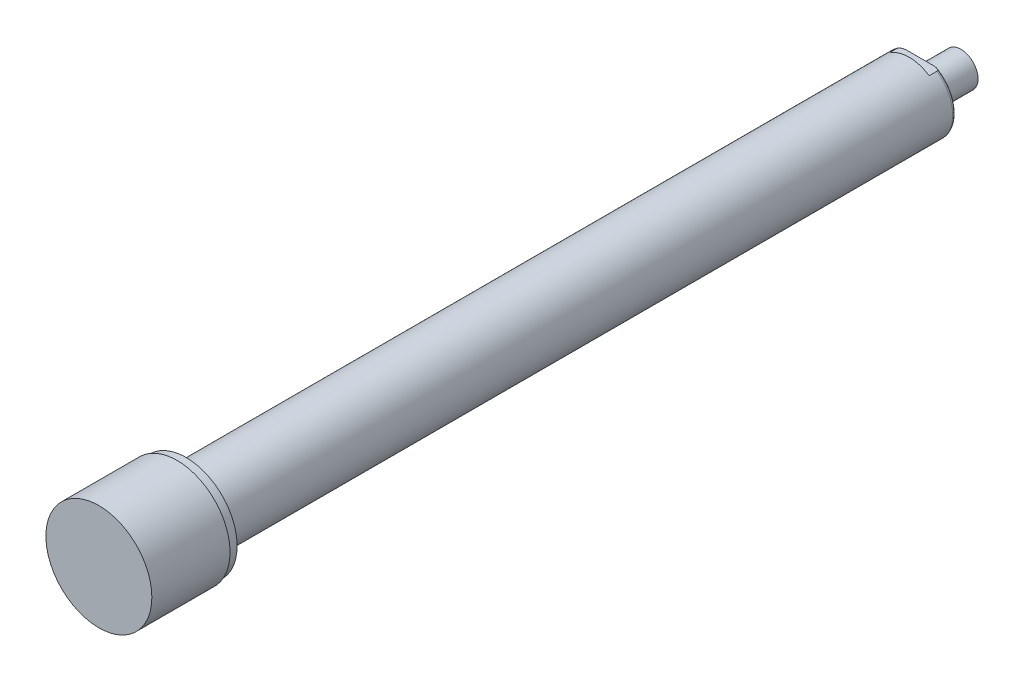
ISO-10303-21;
HEADER;
FILE_DESCRIPTION(('STEP AP214'),'2;1');
FILE_NAME('part.step','',(''),(''),'','','');
FILE_SCHEMA(('AUTOMOTIVE_DESIGN { 1 0 10303 214 1 1 1 1 }'));
ENDSEC;
DATA;
#1=APPLICATION_CONTEXT('core data for automotive mechanical design processes');
#2=APPLICATION_PROTOCOL_DEFINITION('international standard','automotive_design',2000,#1);
#3=PRODUCT_CONTEXT('',#1,'mechanical');
#4=PRODUCT('Part','Part','',(#3));
#5=PRODUCT_RELATED_PRODUCT_CATEGORY('part','',(#4));
#6=PRODUCT_DEFINITION_FORMATION('','',#4);
#7=PRODUCT_DEFINITION_CONTEXT('part definition',#1,'design');
#8=PRODUCT_DEFINITION('design','',#6,#7);
#9=PRODUCT_DEFINITION_SHAPE('','',#8);
#10=(LENGTH_UNIT() NAMED_UNIT(*) SI_UNIT(.MILLI.,.METRE.));
#11=(NAMED_UNIT(*) PLANE_ANGLE_UNIT() SI_UNIT($,.RADIAN.));
#12=(NAMED_UNIT(*) SI_UNIT($,.STERADIAN.) SOLID_ANGLE_UNIT());
#13=UNCERTAINTY_MEASURE_WITH_UNIT(LENGTH_MEASURE(1.E-05),#10,'distance_accuracy_value','');
#14=(GEOMETRIC_REPRESENTATION_CONTEXT(3) GLOBAL_UNCERTAINTY_ASSIGNED_CONTEXT((#13)) GLOBAL_UNIT_ASSIGNED_CONTEXT((#10,
#11,#12)) REPRESENTATION_CONTEXT('',''));
#15=CARTESIAN_POINT('',(0.,0.,0.));
#16=DIRECTION('',(0.,0.,1.));
#17=DIRECTION('',(1.,0.,0.));
#18=AXIS2_PLACEMENT_3D('',#15,#16,#17);
#19=CARTESIAN_POINT('',(0.,0.,2.55016));
#20=DIRECTION('',(0.,0.,1.));
#21=DIRECTION('',(1.,0.,0.));
#22=AXIS2_PLACEMENT_3D('',#19,#20,#21);
#23=PLANE('',#22);
#24=CARTESIAN_POINT('',(0.,0.,2.55016));
#25=DIRECTION('',(0.,0.,1.));
#26=DIRECTION('',(1.,0.,0.));
#27=AXIS2_PLACEMENT_3D('',#24,#25,#26);
#28=CIRCLE('',#27,24.765);
#29=CARTESIAN_POINT('',(24.765,0.,2.55016));
#30=VERTEX_POINT('',#29);
#31=EDGE_CURVE('E153',#30,#30,#28,.T.);
#32=ORIENTED_EDGE('',*,*,#31,.T.);
#33=EDGE_LOOP('',(#32));
#34=FACE_BOUND('',#33,.T.);
#35=ADVANCED_FACE('F16',(#34),#23,.T.);
#36=CARTESIAN_POINT('',(0.,0.,0.));
#37=DIRECTION('',(0.,0.,1.));
#38=DIRECTION('',(1.,0.,0.));
#39=AXIS2_PLACEMENT_3D('',#36,#37,#38);
#40=CYLINDRICAL_SURFACE('',#39,24.765);
#41=CARTESIAN_POINT('',(0.,0.,-34.));
#42=DIRECTION('',(0.,0.,1.));
#43=DIRECTION('',(1.,0.,0.));
#44=AXIS2_PLACEMENT_3D('',#41,#42,#43);
#45=CIRCLE('',#44,24.765);
#46=CARTESIAN_POINT('',(24.765,0.,-34.));
#47=VERTEX_POINT('',#46);
#48=EDGE_CURVE('E25',#47,#47,#45,.F.);
#49=ORIENTED_EDGE('',*,*,#48,.F.);
#50=EDGE_LOOP('',(#49));
#51=FACE_BOUND('',#50,.T.);
#52=ORIENTED_EDGE('',*,*,#31,.F.);
#53=EDGE_LOOP('',(#52));
#54=FACE_BOUND('',#53,.T.);
#55=ADVANCED_FACE('F262',(#51,#54),#40,.T.);
#56=CARTESIAN_POINT('',(0.,20.0152,-34.));
#57=DIRECTION('',(0.,0.,1.));
#58=DIRECTION('',(1.,0.,0.));
#59=AXIS2_PLACEMENT_3D('',#56,#57,#58);
#60=PLANE('',#59);
#61=CARTESIAN_POINT('',(0.,0.,-34.));
#62=DIRECTION('',(0.,0.,1.));
#63=DIRECTION('',(1.,0.,0.));
#64=AXIS2_PLACEMENT_3D('',#61,#62,#63);
#65=CIRCLE('',#64,23.876);
#66=CARTESIAN_POINT('',(23.876,0.,-34.));
#67=VERTEX_POINT('',#66);
#68=EDGE_CURVE('E10',#67,#67,#65,.F.);
#69=ORIENTED_EDGE('',*,*,#68,.F.);
#70=EDGE_LOOP('',(#69));
#71=FACE_BOUND('',#70,.T.);
#72=ORIENTED_EDGE('',*,*,#48,.T.);
#73=EDGE_LOOP('',(#72));
#74=FACE_BOUND('',#73,.T.);
#75=ADVANCED_FACE('F254',(#71,#74),#60,.F.);
#76=CARTESIAN_POINT('',(0.,8.,-400.4204));
#77=DIRECTION('',(0.,0.,-1.));
#78=DIRECTION('',(-1.,0.,0.));
#79=AXIS2_PLACEMENT_3D('',#76,#77,#78);
#80=PLANE('',#79);
#81=CARTESIAN_POINT('',(0.,0.,-400.4204));
#82=DIRECTION('',(0.,0.,-1.));
#83=DIRECTION('',(-1.,0.,0.));
#84=AXIS2_PLACEMENT_3D('',#81,#82,#83);
#85=CIRCLE('',#84,8.);
#86=CARTESIAN_POINT('',(-8.,0.,-400.4204));
#87=VERTEX_POINT('',#86);
#88=EDGE_CURVE('E131',#87,#87,#85,.T.);
#89=ORIENTED_EDGE('',*,*,#88,.T.);
#90=EDGE_LOOP('',(#89));
#91=FACE_BOUND('',#90,.T.);
#92=ADVANCED_FACE('F119',(#91),#80,.T.);
#93=CARTESIAN_POINT('',(0.,0.,-400.4204));
#94=DIRECTION('',(0.,0.,-1.));
#95=DIRECTION('',(-1.,0.,0.));
#96=AXIS2_PLACEMENT_3D('',#93,#94,#95);
#97=CYLINDRICAL_SURFACE('',#96,8.);
#98=CARTESIAN_POINT('',(0.,0.,-383.9104));
#99=DIRECTION('',(0.,0.,-1.));
#100=DIRECTION('',(-1.,0.,0.));
#101=AXIS2_PLACEMENT_3D('',#98,#99,#100);
#102=CIRCLE('',#101,8.);
#103=CARTESIAN_POINT('',(-8.,0.,-383.9104));
#104=VERTEX_POINT('',#103);
#105=EDGE_CURVE('E134',#104,#104,#102,.T.);
#106=ORIENTED_EDGE('',*,*,#105,.T.);
#107=EDGE_LOOP('',(#106));
#108=FACE_BOUND('',#107,.T.);
#109=ORIENTED_EDGE('',*,*,#88,.F.);
#110=EDGE_LOOP('',(#109));
#111=FACE_BOUND('',#110,.T.);
#112=ADVANCED_FACE('F238',(#108,#111),#97,.T.);
#113=CARTESIAN_POINT('',(0.,6.858,-383.9104));
#114=DIRECTION('',(0.,0.,1.));
#115=DIRECTION('',(1.,0.,0.));
#116=AXIS2_PLACEMENT_3D('',#113,#114,#115);
#117=PLANE('',#116);
#118=CARTESIAN_POINT('',(0.,0.,-383.9104));
#119=DIRECTION('',(0.,0.,-1.));
#120=DIRECTION('',(-1.,0.,0.));
#121=AXIS2_PLACEMENT_3D('',#118,#119,#120);
#122=CIRCLE('',#121,6.858);
#123=CARTESIAN_POINT('',(-6.858,0.,-383.9104));
#124=VERTEX_POINT('',#123);
#125=EDGE_CURVE('E137',#124,#124,#122,.T.);
#126=ORIENTED_EDGE('',*,*,#125,.T.);
#127=EDGE_LOOP('',(#126));
#128=FACE_BOUND('',#127,.T.);
#129=ORIENTED_EDGE('',*,*,#105,.F.);
#130=EDGE_LOOP('',(#129));
#131=FACE_BOUND('',#130,.T.);
#132=ADVANCED_FACE('F229',(#128,#131),#117,.T.);
#133=CARTESIAN_POINT('',(0.,0.,-400.4204));
#134=DIRECTION('',(0.,0.,-1.));
#135=DIRECTION('',(-1.,0.,0.));
#136=AXIS2_PLACEMENT_3D('',#133,#134,#135);
#137=CYLINDRICAL_SURFACE('',#136,6.858);
#138=CARTESIAN_POINT('',(0.,0.,-381.3704));
#139=DIRECTION('',(0.,0.,-1.));
#140=DIRECTION('',(-1.,0.,0.));
#141=AXIS2_PLACEMENT_3D('',#138,#139,#140);
#142=CIRCLE('',#141,6.858);
#143=CARTESIAN_POINT('',(-6.858,0.,-381.3704));
#144=VERTEX_POINT('',#143);
#145=EDGE_CURVE('E140',#144,#144,#142,.T.);
#146=ORIENTED_EDGE('',*,*,#145,.T.);
#147=EDGE_LOOP('',(#146));
#148=FACE_BOUND('',#147,.T.);
#149=ORIENTED_EDGE('',*,*,#125,.F.);
#150=EDGE_LOOP('',(#149));
#151=FACE_BOUND('',#150,.T.);
#152=ADVANCED_FACE('F221',(#148,#151),#137,.T.);
#153=CARTESIAN_POINT('',(0.,15.2125,-381.3704));
#154=DIRECTION('',(0.,0.,-1.));
#155=DIRECTION('',(-1.,0.,0.));
#156=AXIS2_PLACEMENT_3D('',#153,#154,#155);
#157=PLANE('',#156);
#158=DIRECTION('',(-1.,0.,0.));
#159=VECTOR('',#158,1.);
#160=CARTESIAN_POINT('',(0.,14.,-381.3704));
#161=LINE('',#160,#159);
#162=CARTESIAN_POINT('',(5.95148353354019,14.,-381.3704));
#163=VERTEX_POINT('',#162);
#164=CARTESIAN_POINT('',(-5.95148353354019,14.,-381.3704));
#165=VERTEX_POINT('',#164);
#166=EDGE_CURVE('E152',#163,#165,#161,.T.);
#167=ORIENTED_EDGE('',*,*,#166,.F.);
#168=CARTESIAN_POINT('',(0.,0.,-381.3704));
#169=DIRECTION('',(0.,0.,-1.));
#170=DIRECTION('',(-1.,0.,0.));
#171=AXIS2_PLACEMENT_3D('',#168,#169,#170);
#172=CIRCLE('',#171,15.2125);
#173=CARTESIAN_POINT('',(5.95148353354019,-14.,-381.3704));
#174=VERTEX_POINT('',#173);
#175=EDGE_CURVE('E143',#163,#174,#172,.T.);
#176=ORIENTED_EDGE('',*,*,#175,.T.);
#177=DIRECTION('',(1.,0.,0.));
#178=VECTOR('',#177,1.);
#179=CARTESIAN_POINT('',(0.,-14.,-381.3704));
#180=LINE('',#179,#178);
#181=CARTESIAN_POINT('',(-5.95148353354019,-14.,-381.3704));
#182=VERTEX_POINT('',#181);
#183=EDGE_CURVE('E150',#182,#174,#180,.T.);
#184=ORIENTED_EDGE('',*,*,#183,.F.);
#185=EDGE_CURVE('E144',#182,#165,#172,.T.);
#186=ORIENTED_EDGE('',*,*,#185,.T.);
#187=EDGE_LOOP('',(#167,#176,#184,#186));
#188=FACE_BOUND('',#187,.T.);
#189=ORIENTED_EDGE('',*,*,#145,.F.);
#190=EDGE_LOOP('',(#189));
#191=FACE_BOUND('',#190,.T.);
#192=ADVANCED_FACE('F214',(#188,#191),#157,.T.);
#193=CARTESIAN_POINT('',(0.,0.,-376.2904));
#194=DIRECTION('',(0.,0.,-1.));
#195=DIRECTION('',(-1.,0.,0.));
#196=AXIS2_PLACEMENT_3D('',#193,#194,#195);
#197=PLANE('',#196);
#198=CARTESIAN_POINT('',(0.,0.,-376.2904));
#199=DIRECTION('',(0.,0.,-1.));
#200=DIRECTION('',(-1.,0.,0.));
#201=AXIS2_PLACEMENT_3D('',#198,#199,#200);
#202=CIRCLE('',#201,16.8);
#203=CARTESIAN_POINT('',(-9.28654941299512,14.,-376.2904));
#204=VERTEX_POINT('',#203);
#205=CARTESIAN_POINT('',(9.28654941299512,14.,-376.2904));
#206=VERTEX_POINT('',#205);
#207=EDGE_CURVE('E72',#204,#206,#202,.T.);
#208=ORIENTED_EDGE('',*,*,#207,.T.);
#209=DIRECTION('',(-1.,0.,0.));
#210=VECTOR('',#209,1.);
#211=CARTESIAN_POINT('',(9.28654941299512,14.,-376.2904));
#212=LINE('',#211,#210);
#213=EDGE_CURVE('E75',#206,#204,#212,.T.);
#214=ORIENTED_EDGE('',*,*,#213,.T.);
#215=EDGE_LOOP('',(#208,#214));
#216=FACE_BOUND('',#215,.T.);
#217=ADVANCED_FACE('F74',(#216),#197,.T.);
#218=CARTESIAN_POINT('',(0.,0.,-379.7829));
#219=DIRECTION('',(0.,0.,-1.));
#220=DIRECTION('',(-1.,0.,0.));
#221=AXIS2_PLACEMENT_3D('',#218,#219,#220);
#222=TOROIDAL_SURFACE('',#221,15.2125,1.5875);
#223=CARTESIAN_POINT('',(0.,14.,-380.807595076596));
#224=CARTESIAN_POINT('',(-0.132768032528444,14.,-380.807593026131));
#225=CARTESIAN_POINT('',(-0.265533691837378,14.,-380.809844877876));
#226=CARTESIAN_POINT('',(-0.53092432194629,14.,-380.818671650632));
#227=CARTESIAN_POINT('',(-0.663549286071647,14.,-380.825246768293));
#228=CARTESIAN_POINT('',(-1.06113740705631,14.,-380.85082076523));
#229=CARTESIAN_POINT('',(-1.32572041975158,14.,-380.875667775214));
#230=CARTESIAN_POINT('',(-1.85467558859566,14.,-380.935304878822));
#231=CARTESIAN_POINT('',(-2.11904315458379,14.,-380.97013225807));
#232=CARTESIAN_POINT('',(-2.64722640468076,14.,-381.043362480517));
#233=CARTESIAN_POINT('',(-2.91104215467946,14.,-381.081764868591));
#234=CARTESIAN_POINT('',(-3.34668840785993,14.,-381.143564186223));
#235=CARTESIAN_POINT('',(-3.51843693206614,14.,-381.16751393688));
#236=CARTESIAN_POINT('',(-3.86222256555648,14.,-381.213226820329));
#237=CARTESIAN_POINT('',(-4.03425968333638,14.,-381.234989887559));
#238=CARTESIAN_POINT('',(-4.55096879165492,14.,-381.295020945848));
#239=CARTESIAN_POINT('',(-4.89633775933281,14.,-381.328046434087));
#240=CARTESIAN_POINT('',(-5.4324845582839,14.,-381.359635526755));
#241=CARTESIAN_POINT('',(-5.62271612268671,14.,-381.367024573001));
#242=CARTESIAN_POINT('',(-6.00342493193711,14.,-381.371964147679));
#243=CARTESIAN_POINT('',(-6.19390224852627,14.,-381.369510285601));
#244=CARTESIAN_POINT('',(-6.57443040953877,14.,-381.35206589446));
#245=CARTESIAN_POINT('',(-6.76448114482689,14.,-381.337072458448));
#246=CARTESIAN_POINT('',(-7.04800150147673,14.,-381.302528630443));
#247=CARTESIAN_POINT('',(-7.14221305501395,14.,-381.289012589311));
#248=CARTESIAN_POINT('',(-7.32985530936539,14.,-381.257394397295));
#249=CARTESIAN_POINT('',(-7.42328618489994,14.,-381.239293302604));
#250=CARTESIAN_POINT('',(-7.60981224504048,14.,-381.197657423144));
#251=CARTESIAN_POINT('',(-7.70289714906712,14.,-381.174075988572));
#252=CARTESIAN_POINT('',(-7.88726094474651,14.,-381.12074825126));
#253=CARTESIAN_POINT('',(-7.97854070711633,14.,-381.09100500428));
#254=CARTESIAN_POINT('',(-8.15800808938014,14.,-381.024496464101));
#255=CARTESIAN_POINT('',(-8.24620915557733,14.,-380.987767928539));
#256=CARTESIAN_POINT('',(-8.41861308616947,14.,-380.905991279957));
#257=CARTESIAN_POINT('',(-8.50282110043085,14.,-380.860954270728));
#258=CARTESIAN_POINT('',(-8.6473963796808,14.,-380.772038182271));
#259=CARTESIAN_POINT('',(-8.70893575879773,14.,-380.730080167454));
#260=CARTESIAN_POINT('',(-8.82695536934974,14.,-380.639330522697));
#261=CARTESIAN_POINT('',(-8.88342980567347,14.,-380.590531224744));
#262=CARTESIAN_POINT('',(-8.98963579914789,14.,-380.484856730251));
#263=CARTESIAN_POINT('',(-9.03928619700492,14.,-380.427898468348));
#264=CARTESIAN_POINT('',(-9.12777987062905,14.,-380.3061116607));
#265=CARTESIAN_POINT('',(-9.16665238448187,14.,-380.24130510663));
#266=CARTESIAN_POINT('',(-9.22003745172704,14.,-380.125711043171));
#267=CARTESIAN_POINT('',(-9.23836397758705,14.,-380.076688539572));
#268=CARTESIAN_POINT('',(-9.26663253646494,14.,-379.976274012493));
#269=CARTESIAN_POINT('',(-9.27658176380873,14.,-379.924884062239));
#270=CARTESIAN_POINT('',(-9.28727482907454,14.,-379.82094216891));
#271=CARTESIAN_POINT('',(-9.28798383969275,14.,-379.76838657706));
#272=CARTESIAN_POINT('',(-9.28004044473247,14.,-379.66398713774));
#273=CARTESIAN_POINT('',(-9.27138562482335,14.,-379.612143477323));
#274=CARTESIAN_POINT('',(-9.24609238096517,14.,-379.513096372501));
#275=CARTESIAN_POINT('',(-9.22985055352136,14.,-379.465789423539));
#276=CARTESIAN_POINT('',(-9.19066177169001,14.,-379.374071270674));
#277=CARTESIAN_POINT('',(-9.16771223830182,14.,-379.329661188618));
#278=CARTESIAN_POINT('',(-9.10285320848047,14.,-379.221841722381));
#279=CARTESIAN_POINT('',(-9.05730159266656,14.,-379.160624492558));
#280=CARTESIAN_POINT('',(-8.95711629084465,14.,-379.04613877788));
#281=CARTESIAN_POINT('',(-8.90245884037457,14.,-378.992891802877));
#282=CARTESIAN_POINT('',(-8.75205778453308,14.,-378.863960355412));
#283=CARTESIAN_POINT('',(-8.65138838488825,14.,-378.794065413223));
#284=CARTESIAN_POINT('',(-8.44094705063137,14.,-378.669906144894));
#285=CARTESIAN_POINT('',(-8.33115456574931,14.,-378.615678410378));
#286=CARTESIAN_POINT('',(-8.11312892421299,14.,-378.522886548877));
#287=CARTESIAN_POINT('',(-8.00521018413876,14.,-378.483567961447));
#288=CARTESIAN_POINT('',(-7.78638225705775,14.,-378.414218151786));
#289=CARTESIAN_POINT('',(-7.67547044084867,14.,-378.38419540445));
#290=CARTESIAN_POINT('',(-7.45172845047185,14.,-378.33194530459));
#291=CARTESIAN_POINT('',(-7.33889625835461,14.,-378.309726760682));
#292=CARTESIAN_POINT('',(-7.11210332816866,14.,-378.271935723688));
#293=CARTESIAN_POINT('',(-6.9981421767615,14.,-378.256365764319));
#294=CARTESIAN_POINT('',(-6.76357841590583,14.,-378.230250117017));
#295=CARTESIAN_POINT('',(-6.64294221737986,14.,-378.220012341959));
#296=CARTESIAN_POINT('',(-6.40132401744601,14.,-378.204929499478));
#297=CARTESIAN_POINT('',(-6.2803419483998,14.,-378.20008557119));
#298=CARTESIAN_POINT('',(-5.91706739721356,14.,-378.192460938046));
#299=CARTESIAN_POINT('',(-5.67462782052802,14.,-378.196605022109));
#300=CARTESIAN_POINT('',(-5.18958172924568,14.,-378.218383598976));
#301=CARTESIAN_POINT('',(-4.94697788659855,14.,-378.236067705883));
#302=CARTESIAN_POINT('',(-4.4628147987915,14.,-378.280899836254));
#303=CARTESIAN_POINT('',(-4.22125506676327,14.,-378.30804282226));
#304=CARTESIAN_POINT('',(-3.66652722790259,14.,-378.377108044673));
#305=CARTESIAN_POINT('',(-3.35361868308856,14.,-378.421021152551));
#306=CARTESIAN_POINT('',(-2.72786060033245,14.,-378.51038682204));
#307=CARTESIAN_POINT('',(-2.41501121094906,14.,-378.555840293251));
#308=CARTESIAN_POINT('',(-1.79091906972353,14.,-378.638284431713));
#309=CARTESIAN_POINT('',(-1.47968696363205,14.,-378.675347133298));
#310=CARTESIAN_POINT('',(-1.01173384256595,14.,-378.717283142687));
#311=CARTESIAN_POINT('',(-0.855647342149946,14.,-378.728982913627));
#312=CARTESIAN_POINT('',(-0.54315474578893,14.,-378.746808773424));
#313=CARTESIAN_POINT('',(-0.386748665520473,14.,-378.752935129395));
#314=CARTESIAN_POINT('',(-0.0729452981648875,14.,-378.759018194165));
#315=CARTESIAN_POINT('',(0.084452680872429,14.,-378.758940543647));
#316=CARTESIAN_POINT('',(0.39912093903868,14.,-378.752538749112));
#317=CARTESIAN_POINT('',(0.556391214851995,14.,-378.746214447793));
#318=CARTESIAN_POINT('',(0.870747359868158,14.,-378.727945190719));
#319=CARTESIAN_POINT('',(1.02783290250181,14.,-378.715994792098));
#320=CARTESIAN_POINT('',(1.34159739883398,14.,-378.687550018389));
#321=CARTESIAN_POINT('',(1.4982763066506,14.,-378.671055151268));
#322=CARTESIAN_POINT('',(1.81316576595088,14.,-378.634583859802));
#323=CARTESIAN_POINT('',(1.97137154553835,14.,-378.614567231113));
#324=CARTESIAN_POINT('',(2.28750928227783,14.,-378.572537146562));
#325=CARTESIAN_POINT('',(2.4454412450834,14.,-378.550523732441));
#326=CARTESIAN_POINT('',(2.91891159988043,14.,-378.483449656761));
#327=CARTESIAN_POINT('',(3.23429351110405,14.,-378.437332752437));
#328=CARTESIAN_POINT('',(3.86696922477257,14.,-378.351141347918));
#329=CARTESIAN_POINT('',(4.18426592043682,14.,-378.31108632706));
#330=CARTESIAN_POINT('',(4.66160221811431,14.,-378.261907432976));
#331=CARTESIAN_POINT('',(4.82106369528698,14.,-378.247325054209));
#332=CARTESIAN_POINT('',(5.14034359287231,14.,-378.222922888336));
#333=CARTESIAN_POINT('',(5.30016197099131,14.,-378.213102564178));
#334=CARTESIAN_POINT('',(5.61795638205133,14.,-378.199521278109));
#335=CARTESIAN_POINT('',(5.77592887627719,14.,-378.195682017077));
#336=CARTESIAN_POINT('',(6.09195057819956,14.,-378.19514758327));
#337=CARTESIAN_POINT('',(6.24999979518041,14.,-378.198454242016));
#338=CARTESIAN_POINT('',(6.56527224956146,14.,-378.213786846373));
#339=CARTESIAN_POINT('',(6.72249656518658,14.,-378.225789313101));
#340=CARTESIAN_POINT('',(7.0357312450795,14.,-378.260441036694));
#341=CARTESIAN_POINT('',(7.1917424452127,14.,-378.283082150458));
#342=CARTESIAN_POINT('',(7.41615197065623,14.,-378.325489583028));
#343=CARTESIAN_POINT('',(7.48555710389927,14.,-378.339991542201));
#344=CARTESIAN_POINT('',(7.62369369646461,14.,-378.371975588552));
#345=CARTESIAN_POINT('',(7.69242507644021,14.,-378.389458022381));
#346=CARTESIAN_POINT('',(7.82924857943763,14.,-378.427814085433));
#347=CARTESIAN_POINT('',(7.89733687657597,14.,-378.448701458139));
#348=CARTESIAN_POINT('',(8.03225786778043,14.,-378.494211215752));
#349=CARTESIAN_POINT('',(8.09909066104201,14.,-378.518833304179));
#350=CARTESIAN_POINT('',(8.23194606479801,14.,-378.572631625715));
#351=CARTESIAN_POINT('',(8.29794618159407,14.,-378.601863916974));
#352=CARTESIAN_POINT('',(8.42761843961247,14.,-378.665218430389));
#353=CARTESIAN_POINT('',(8.49128951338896,14.,-378.699342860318));
#354=CARTESIAN_POINT('',(8.61506191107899,14.,-378.77292848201));
#355=CARTESIAN_POINT('',(8.6751799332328,14.,-378.812361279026));
#356=CARTESIAN_POINT('',(8.79087032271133,14.,-378.897343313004));
#357=CARTESIAN_POINT('',(8.84644896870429,14.,-378.942883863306));
#358=CARTESIAN_POINT('',(8.94548291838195,14.,-379.035317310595));
#359=CARTESIAN_POINT('',(8.98959902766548,14.,-379.081494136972));
#360=CARTESIAN_POINT('',(9.071127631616,14.,-379.179534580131));
#361=CARTESIAN_POINT('',(9.10853908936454,14.,-379.231399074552));
#362=CARTESIAN_POINT('',(9.17478487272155,14.,-379.341313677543));
#363=CARTESIAN_POINT('',(9.20351043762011,14.,-379.399430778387));
#364=CARTESIAN_POINT('',(9.24908813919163,14.,-379.520152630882));
#365=CARTESIAN_POINT('',(9.26596285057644,14.,-379.582748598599));
#366=CARTESIAN_POINT('',(9.28464960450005,14.,-379.702335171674));
#367=CARTESIAN_POINT('',(9.28804963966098,14.,-379.75907661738));
#368=CARTESIAN_POINT('',(9.28382966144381,14.,-379.872145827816));
#369=CARTESIAN_POINT('',(9.27621073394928,14.,-379.928473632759));
#370=CARTESIAN_POINT('',(9.25229003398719,14.,-380.032102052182));
#371=CARTESIAN_POINT('',(9.23713577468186,14.,-380.079676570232));
#372=CARTESIAN_POINT('',(9.19997892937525,14.,-380.172038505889));
#373=CARTESIAN_POINT('',(9.17797466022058,14.,-380.216825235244));
#374=CARTESIAN_POINT('',(9.11609014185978,14.,-380.324302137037));
#375=CARTESIAN_POINT('',(9.07273694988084,14.,-380.384990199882));
#376=CARTESIAN_POINT('',(8.97697606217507,14.,-380.498741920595));
#377=CARTESIAN_POINT('',(8.92454537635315,14.,-380.551785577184));
#378=CARTESIAN_POINT('',(8.78073012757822,14.,-380.679735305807));
#379=CARTESIAN_POINT('',(8.68454281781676,14.,-380.749202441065));
#380=CARTESIAN_POINT('',(8.48303059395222,14.,-380.873115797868));
#381=CARTESIAN_POINT('',(8.37768429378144,14.,-380.927525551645));
#382=CARTESIAN_POINT('',(8.16908427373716,14.,-381.020673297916));
#383=CARTESIAN_POINT('',(8.06619117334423,14.,-381.060235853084));
#384=CARTESIAN_POINT('',(7.8573703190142,14.,-381.130483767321));
#385=CARTESIAN_POINT('',(7.75143986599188,14.,-381.161160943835));
#386=CARTESIAN_POINT('',(7.53762663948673,14.,-381.215024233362));
#387=CARTESIAN_POINT('',(7.42974224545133,14.,-381.238203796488));
#388=CARTESIAN_POINT('',(7.21287186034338,14.,-381.278141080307));
#389=CARTESIAN_POINT('',(7.10388648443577,14.,-381.294902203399));
#390=CARTESIAN_POINT('',(6.89130219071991,14.,-381.322143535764));
#391=CARTESIAN_POINT('',(6.78774054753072,14.,-381.332921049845));
#392=CARTESIAN_POINT('',(6.5802549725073,14.,-381.350196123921));
#393=CARTESIAN_POINT('',(6.4763309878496,14.,-381.356693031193));
#394=CARTESIAN_POINT('',(6.16416768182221,14.,-381.370589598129));
#395=CARTESIAN_POINT('',(5.9556742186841,14.,-381.372379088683));
#396=CARTESIAN_POINT('',(5.53835436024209,14.,-381.36450473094));
#397=CARTESIAN_POINT('',(5.32952888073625,14.,-381.354806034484));
#398=CARTESIAN_POINT('',(4.91243398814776,14.,-381.326724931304));
#399=CARTESIAN_POINT('',(4.70416474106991,14.,-381.308340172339));
#400=CARTESIAN_POINT('',(4.28654719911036,14.,-381.265186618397));
#401=CARTESIAN_POINT('',(4.07720452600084,14.,-381.240365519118));
#402=CARTESIAN_POINT('',(3.65905089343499,14.,-381.186814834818));
#403=CARTESIAN_POINT('',(3.45023989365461,14.,-381.158085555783));
#404=CARTESIAN_POINT('',(3.0331678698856,14.,-381.099210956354));
#405=CARTESIAN_POINT('',(2.82490650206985,14.,-381.069067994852));
#406=CARTESIAN_POINT('',(2.40822602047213,14.,-381.009971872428));
#407=CARTESIAN_POINT('',(2.19980692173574,14.,-380.981018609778));
#408=CARTESIAN_POINT('',(1.82558056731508,14.,-380.932810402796));
#409=CARTESIAN_POINT('',(1.65987471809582,14.,-380.912788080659));
#410=CARTESIAN_POINT('',(1.32795613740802,14.,-380.876904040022));
#411=CARTESIAN_POINT('',(1.16174328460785,14.,-380.861043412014));
#412=CARTESIAN_POINT('',(0.829734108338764,14.,-380.835025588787));
#413=CARTESIAN_POINT('',(0.663940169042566,14.,-380.824838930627));
#414=CARTESIAN_POINT('',(0.332096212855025,14.,-380.811125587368));
#415=CARTESIAN_POINT('',(0.166046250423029,14.,-380.807597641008));
#416=CARTESIAN_POINT('',(0.,14.,-380.807595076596));
#417=B_SPLINE_CURVE_WITH_KNOTS('',3,(#223,#224,#225,#226,#227,#228,#229,#230,#231,#232,#233,
#234,#235,#236,#237,#238,#239,#240,#241,#242,#243,#244,#245,#246,#247,#248,#249,#250,#251,#252,
#253,#254,#255,#256,#257,#258,#259,#260,#261,#262,#263,#264,#265,#266,#267,#268,#269,#270,#271,
#272,#273,#274,#275,#276,#277,#278,#279,#280,#281,#282,#283,#284,#285,#286,#287,#288,#289,#290,
#291,#292,#293,#294,#295,#296,#297,#298,#299,#300,#301,#302,#303,#304,#305,#306,#307,#308,#309,
#310,#311,#312,#313,#314,#315,#316,#317,#318,#319,#320,#321,#322,#323,#324,#325,#326,#327,#328,
#329,#330,#331,#332,#333,#334,#335,#336,#337,#338,#339,#340,#341,#342,#343,#344,#345,#346,#347,
#348,#349,#350,#351,#352,#353,#354,#355,#356,#357,#358,#359,#360,#361,#362,#363,#364,#365,#366,
#367,#368,#369,#370,#371,#372,#373,#374,#375,#376,#377,#378,#379,#380,#381,#382,#383,#384,#385,
#386,#387,#388,#389,#390,#391,#392,#393,#394,#395,#396,#397,#398,#399,#400,#401,#402,#403,#404,
#405,#406,#407,#408,#409,#410,#411,#412,#413,#414,#415,#416),.UNSPECIFIED.,.T.,.F.,(4,2,2,2,2,2,
2,2,2,2,2,2,2,2,2,2,2,2,2,2,2,2,2,2,2,2,2,2,2,2,2,2,2,2,2,2,2,2,2,2,2,2,2,2,2,2,2,2,2,2,2,2,2,2,
2,2,2,2,2,2,2,2,2,2,2,2,2,2,2,2,2,2,2,2,2,2,2,2,2,2,2,2,2,2,2,2,2,2,2,2,2,2,2,2,2,2,4),(0.,
0.398281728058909,0.796581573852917,1.59346088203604,2.39335695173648,3.19315132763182,
3.71336857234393,4.23360141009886,5.27376582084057,5.84469365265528,6.41587617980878,
6.98719115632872,7.27262913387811,7.55800141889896,7.84589809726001,8.13365234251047,
8.41993230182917,8.70583240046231,8.92889552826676,9.15221070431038,9.37798665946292,
9.60314400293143,9.75952095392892,9.91576347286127,10.0725947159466,10.2294664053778,
10.3789250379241,10.5284412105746,10.7560526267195,10.9842676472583,11.3498680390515,
11.7163155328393,12.0603788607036,12.4047549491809,12.7495184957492,13.094413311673,
13.4574784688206,13.8206202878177,14.5474486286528,15.276953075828,16.0060696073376,
16.9539379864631,17.902376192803,18.8423341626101,19.3118216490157,19.7812866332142,
20.2533518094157,20.7254288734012,21.1979635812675,21.6705494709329,22.1489292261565,
22.6272989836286,23.5835269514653,24.5427652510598,25.0230897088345,25.503359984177,
25.9772884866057,26.4513384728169,26.9241132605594,27.3965267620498,27.6091866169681,
27.8218712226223,28.0354365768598,28.2489849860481,28.4653650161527,28.6818430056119,
28.8972059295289,29.1122657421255,29.3033629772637,29.4944897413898,29.687919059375,
29.8809789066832,30.0504588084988,30.2199220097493,30.3691164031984,30.518347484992,
30.7408251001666,30.963874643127,31.3178265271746,31.6726282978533,32.0028505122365,
32.3333758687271,32.6641891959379,32.994826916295,33.3070886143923,33.6193979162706,
34.2444298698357,34.871362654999,35.4984653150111,36.1308331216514,36.7631514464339,
37.3944498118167,38.0256940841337,38.5263936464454,39.0272242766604,39.5254294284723,
40.0235402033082),.UNSPECIFIED.);
#418=CARTESIAN_POINT('',(9.28654941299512,14.,-379.7829));
#419=VERTEX_POINT('',#418);
#420=EDGE_CURVE('E33',#419,#163,#417,.T.);
#421=ORIENTED_EDGE('',*,*,#420,.F.);
#422=CARTESIAN_POINT('',(0.,0.,-379.7829));
#423=DIRECTION('',(0.,0.,-1.));
#424=DIRECTION('',(-1.,0.,0.));
#425=AXIS2_PLACEMENT_3D('',#422,#423,#424);
#426=CIRCLE('',#425,16.8);
#427=CARTESIAN_POINT('',(9.28654941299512,-14.,-379.7829));
#428=VERTEX_POINT('',#427);
#429=EDGE_CURVE('E88',#419,#428,#426,.T.);
#430=ORIENTED_EDGE('',*,*,#429,.T.);
#431=CARTESIAN_POINT('',(0.,-14.,-380.807595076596));
#432=CARTESIAN_POINT('',(0.132768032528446,-14.,-380.807593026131));
#433=CARTESIAN_POINT('',(0.265533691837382,-14.,-380.809844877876));
#434=CARTESIAN_POINT('',(0.530924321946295,-14.,-380.818671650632));
#435=CARTESIAN_POINT('',(0.663549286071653,-14.,-380.825246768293));
#436=CARTESIAN_POINT('',(1.06113740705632,-14.,-380.85082076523));
#437=CARTESIAN_POINT('',(1.3257204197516,-14.,-380.875667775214));
#438=CARTESIAN_POINT('',(1.85467558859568,-14.,-380.935304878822));
#439=CARTESIAN_POINT('',(2.1190431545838,-14.,-380.97013225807));
#440=CARTESIAN_POINT('',(2.64722640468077,-14.,-381.043362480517));
#441=CARTESIAN_POINT('',(2.91104215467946,-14.,-381.081764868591));
#442=CARTESIAN_POINT('',(3.34668840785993,-14.,-381.143564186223));
#443=CARTESIAN_POINT('',(3.51843693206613,-14.,-381.16751393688));
#444=CARTESIAN_POINT('',(3.86222256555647,-14.,-381.213226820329));
#445=CARTESIAN_POINT('',(4.03425968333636,-14.,-381.234989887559));
#446=CARTESIAN_POINT('',(4.5509687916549,-14.,-381.295020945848));
#447=CARTESIAN_POINT('',(4.89633775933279,-14.,-381.328046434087));
#448=CARTESIAN_POINT('',(5.43248455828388,-14.,-381.359635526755));
#449=CARTESIAN_POINT('',(5.62271612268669,-14.,-381.367024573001));
#450=CARTESIAN_POINT('',(6.00342493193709,-14.,-381.371964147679));
#451=CARTESIAN_POINT('',(6.19390224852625,-14.,-381.369510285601));
#452=CARTESIAN_POINT('',(6.57443040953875,-14.,-381.35206589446));
#453=CARTESIAN_POINT('',(6.76448114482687,-14.,-381.337072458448));
#454=CARTESIAN_POINT('',(7.04800150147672,-14.,-381.302528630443));
#455=CARTESIAN_POINT('',(7.14221305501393,-14.,-381.289012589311));
#456=CARTESIAN_POINT('',(7.32985530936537,-14.,-381.257394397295));
#457=CARTESIAN_POINT('',(7.42328618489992,-14.,-381.239293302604));
#458=CARTESIAN_POINT('',(7.60981224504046,-14.,-381.197657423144));
#459=CARTESIAN_POINT('',(7.70289714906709,-14.,-381.174075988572));
#460=CARTESIAN_POINT('',(7.88726094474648,-14.,-381.12074825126));
#461=CARTESIAN_POINT('',(7.9785407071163,-14.,-381.09100500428));
#462=CARTESIAN_POINT('',(8.15800808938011,-14.,-381.024496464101));
#463=CARTESIAN_POINT('',(8.2462091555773,-14.,-380.987767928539));
#464=CARTESIAN_POINT('',(8.41861308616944,-14.,-380.905991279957));
#465=CARTESIAN_POINT('',(8.50282110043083,-14.,-380.860954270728));
#466=CARTESIAN_POINT('',(8.64739637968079,-14.,-380.772038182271));
#467=CARTESIAN_POINT('',(8.70893575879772,-14.,-380.730080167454));
#468=CARTESIAN_POINT('',(8.82695536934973,-14.,-380.639330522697));
#469=CARTESIAN_POINT('',(8.88342980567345,-14.,-380.590531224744));
#470=CARTESIAN_POINT('',(8.98963579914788,-14.,-380.484856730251));
#471=CARTESIAN_POINT('',(9.03928619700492,-14.,-380.427898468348));
#472=CARTESIAN_POINT('',(9.12777987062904,-14.,-380.3061116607));
#473=CARTESIAN_POINT('',(9.16665238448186,-14.,-380.24130510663));
#474=CARTESIAN_POINT('',(9.22003745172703,-14.,-380.125711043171));
#475=CARTESIAN_POINT('',(9.23836397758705,-14.,-380.076688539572));
#476=CARTESIAN_POINT('',(9.26663253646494,-14.,-379.976274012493));
#477=CARTESIAN_POINT('',(9.27658176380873,-14.,-379.924884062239));
#478=CARTESIAN_POINT('',(9.28727482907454,-14.,-379.82094216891));
#479=CARTESIAN_POINT('',(9.28798383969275,-14.,-379.76838657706));
#480=CARTESIAN_POINT('',(9.28004044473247,-14.,-379.66398713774));
#481=CARTESIAN_POINT('',(9.27138562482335,-14.,-379.612143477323));
#482=CARTESIAN_POINT('',(9.24609238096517,-14.,-379.513096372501));
#483=CARTESIAN_POINT('',(9.22985055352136,-14.,-379.465789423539));
#484=CARTESIAN_POINT('',(9.19066177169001,-14.,-379.374071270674));
#485=CARTESIAN_POINT('',(9.16771223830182,-14.,-379.329661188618));
#486=CARTESIAN_POINT('',(9.10285320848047,-14.,-379.221841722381));
#487=CARTESIAN_POINT('',(9.05730159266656,-14.,-379.160624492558));
#488=CARTESIAN_POINT('',(8.95711629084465,-14.,-379.04613877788));
#489=CARTESIAN_POINT('',(8.90245884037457,-14.,-378.992891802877));
#490=CARTESIAN_POINT('',(8.75205778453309,-14.,-378.863960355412));
#491=CARTESIAN_POINT('',(8.65138838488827,-14.,-378.794065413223));
#492=CARTESIAN_POINT('',(8.44094705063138,-14.,-378.669906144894));
#493=CARTESIAN_POINT('',(8.33115456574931,-14.,-378.615678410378));
#494=CARTESIAN_POINT('',(8.11312892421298,-14.,-378.522886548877));
#495=CARTESIAN_POINT('',(8.00521018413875,-14.,-378.483567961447));
#496=CARTESIAN_POINT('',(7.78638225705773,-14.,-378.414218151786));
#497=CARTESIAN_POINT('',(7.67547044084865,-14.,-378.38419540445));
#498=CARTESIAN_POINT('',(7.45172845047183,-14.,-378.33194530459));
#499=CARTESIAN_POINT('',(7.3388962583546,-14.,-378.309726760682));
#500=CARTESIAN_POINT('',(7.11210332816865,-14.,-378.271935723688));
#501=CARTESIAN_POINT('',(6.99814217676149,-14.,-378.256365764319));
#502=CARTESIAN_POINT('',(6.76357841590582,-14.,-378.230250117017));
#503=CARTESIAN_POINT('',(6.64294221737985,-14.,-378.220012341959));
#504=CARTESIAN_POINT('',(6.40132401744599,-14.,-378.204929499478));
#505=CARTESIAN_POINT('',(6.28034194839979,-14.,-378.20008557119));
#506=CARTESIAN_POINT('',(5.91706739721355,-14.,-378.192460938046));
#507=CARTESIAN_POINT('',(5.674627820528,-14.,-378.196605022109));
#508=CARTESIAN_POINT('',(5.18958172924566,-14.,-378.218383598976));
#509=CARTESIAN_POINT('',(4.94697788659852,-14.,-378.236067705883));
#510=CARTESIAN_POINT('',(4.46281479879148,-14.,-378.280899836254));
#511=CARTESIAN_POINT('',(4.22125506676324,-14.,-378.30804282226));
#512=CARTESIAN_POINT('',(3.66652722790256,-14.,-378.377108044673));
#513=CARTESIAN_POINT('',(3.35361868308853,-14.,-378.421021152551));
#514=CARTESIAN_POINT('',(2.72786060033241,-14.,-378.51038682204));
#515=CARTESIAN_POINT('',(2.41501121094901,-14.,-378.555840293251));
#516=CARTESIAN_POINT('',(1.79091906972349,-14.,-378.638284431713));
#517=CARTESIAN_POINT('',(1.479686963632,-14.,-378.675347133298));
#518=CARTESIAN_POINT('',(1.0117338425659,-14.,-378.717283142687));
#519=CARTESIAN_POINT('',(0.8556473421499,-14.,-378.728982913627));
#520=CARTESIAN_POINT('',(0.543154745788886,-14.,-378.746808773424));
#521=CARTESIAN_POINT('',(0.386748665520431,-14.,-378.752935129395));
#522=CARTESIAN_POINT('',(0.0729452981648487,-14.,-378.759018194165));
#523=CARTESIAN_POINT('',(-0.0844526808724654,-14.,-378.758940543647));
#524=CARTESIAN_POINT('',(-0.399120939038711,-14.,-378.752538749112));
#525=CARTESIAN_POINT('',(-0.556391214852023,-14.,-378.746214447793));
#526=CARTESIAN_POINT('',(-0.870747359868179,-14.,-378.727945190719));
#527=CARTESIAN_POINT('',(-1.02783290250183,-14.,-378.715994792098));
#528=CARTESIAN_POINT('',(-1.34159739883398,-14.,-378.687550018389));
#529=CARTESIAN_POINT('',(-1.4982763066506,-14.,-378.671055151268));
#530=CARTESIAN_POINT('',(-1.81316576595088,-14.,-378.634583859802));
#531=CARTESIAN_POINT('',(-1.97137154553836,-14.,-378.614567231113));
#532=CARTESIAN_POINT('',(-2.28750928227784,-14.,-378.572537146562));
#533=CARTESIAN_POINT('',(-2.44544124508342,-14.,-378.550523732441));
#534=CARTESIAN_POINT('',(-2.91891159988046,-14.,-378.483449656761));
#535=CARTESIAN_POINT('',(-3.2342935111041,-14.,-378.437332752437));
#536=CARTESIAN_POINT('',(-3.86696922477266,-14.,-378.351141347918));
#537=CARTESIAN_POINT('',(-4.18426592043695,-14.,-378.31108632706));
#538=CARTESIAN_POINT('',(-4.66160221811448,-14.,-378.261907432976));
#539=CARTESIAN_POINT('',(-4.82106369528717,-14.,-378.247325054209));
#540=CARTESIAN_POINT('',(-5.14034359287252,-14.,-378.222922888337));
#541=CARTESIAN_POINT('',(-5.30016197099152,-14.,-378.213102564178));
#542=CARTESIAN_POINT('',(-5.61795638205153,-14.,-378.199521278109));
#543=CARTESIAN_POINT('',(-5.77592887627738,-14.,-378.195682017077));
#544=CARTESIAN_POINT('',(-6.0919505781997,-14.,-378.19514758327));
#545=CARTESIAN_POINT('',(-6.24999979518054,-14.,-378.198454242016));
#546=CARTESIAN_POINT('',(-6.56527224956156,-14.,-378.213786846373));
#547=CARTESIAN_POINT('',(-6.72249656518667,-14.,-378.225789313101));
#548=CARTESIAN_POINT('',(-7.03573124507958,-14.,-378.260441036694));
#549=CARTESIAN_POINT('',(-7.19174244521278,-14.,-378.283082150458));
#550=CARTESIAN_POINT('',(-7.41615197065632,-14.,-378.325489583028));
#551=CARTESIAN_POINT('',(-7.48555710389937,-14.,-378.339991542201));
#552=CARTESIAN_POINT('',(-7.62369369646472,-14.,-378.371975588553));
#553=CARTESIAN_POINT('',(-7.69242507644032,-14.,-378.389458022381));
#554=CARTESIAN_POINT('',(-7.82924857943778,-14.,-378.427814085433));
#555=CARTESIAN_POINT('',(-7.89733687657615,-14.,-378.448701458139));
#556=CARTESIAN_POINT('',(-8.03225786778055,-14.,-378.494211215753));
#557=CARTESIAN_POINT('',(-8.09909066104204,-14.,-378.518833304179));
#558=CARTESIAN_POINT('',(-8.23194606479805,-14.,-378.572631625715));
#559=CARTESIAN_POINT('',(-8.29794618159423,-14.,-378.601863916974));
#560=CARTESIAN_POINT('',(-8.4276184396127,-14.,-378.665218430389));
#561=CARTESIAN_POINT('',(-8.49128951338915,-14.,-378.699342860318));
#562=CARTESIAN_POINT('',(-8.61506191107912,-14.,-378.77292848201));
#563=CARTESIAN_POINT('',(-8.67517993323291,-14.,-378.812361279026));
#564=CARTESIAN_POINT('',(-8.79087032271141,-14.,-378.897343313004));
#565=CARTESIAN_POINT('',(-8.84644896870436,-14.,-378.942883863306));
#566=CARTESIAN_POINT('',(-8.94548291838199,-14.,-379.035317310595));
#567=CARTESIAN_POINT('',(-8.9895990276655,-14.,-379.081494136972));
#568=CARTESIAN_POINT('',(-9.07112763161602,-14.,-379.179534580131));
#569=CARTESIAN_POINT('',(-9.10853908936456,-14.,-379.231399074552));
#570=CARTESIAN_POINT('',(-9.17478487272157,-14.,-379.341313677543));
#571=CARTESIAN_POINT('',(-9.20351043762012,-14.,-379.399430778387));
#572=CARTESIAN_POINT('',(-9.24908813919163,-14.,-379.520152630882));
#573=CARTESIAN_POINT('',(-9.26596285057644,-14.,-379.582748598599));
#574=CARTESIAN_POINT('',(-9.28464960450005,-14.,-379.702335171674));
#575=CARTESIAN_POINT('',(-9.28804963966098,-14.,-379.75907661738));
#576=CARTESIAN_POINT('',(-9.28382966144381,-14.,-379.872145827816));
#577=CARTESIAN_POINT('',(-9.27621073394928,-14.,-379.928473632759));
#578=CARTESIAN_POINT('',(-9.25229003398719,-14.,-380.032102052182));
#579=CARTESIAN_POINT('',(-9.23713577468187,-14.,-380.079676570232));
#580=CARTESIAN_POINT('',(-9.19997892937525,-14.,-380.172038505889));
#581=CARTESIAN_POINT('',(-9.17797466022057,-14.,-380.216825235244));
#582=CARTESIAN_POINT('',(-9.11609014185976,-14.,-380.324302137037));
#583=CARTESIAN_POINT('',(-9.07273694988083,-14.,-380.384990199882));
#584=CARTESIAN_POINT('',(-8.97697606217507,-14.,-380.498741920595));
#585=CARTESIAN_POINT('',(-8.92454537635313,-14.,-380.551785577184));
#586=CARTESIAN_POINT('',(-8.7807301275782,-14.,-380.679735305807));
#587=CARTESIAN_POINT('',(-8.68454281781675,-14.,-380.749202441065));
#588=CARTESIAN_POINT('',(-8.4830305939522,-14.,-380.873115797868));
#589=CARTESIAN_POINT('',(-8.37768429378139,-14.,-380.927525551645));
#590=CARTESIAN_POINT('',(-8.16908427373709,-14.,-381.020673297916));
#591=CARTESIAN_POINT('',(-8.06619117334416,-14.,-381.060235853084));
#592=CARTESIAN_POINT('',(-7.85737031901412,-14.,-381.130483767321));
#593=CARTESIAN_POINT('',(-7.75143986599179,-14.,-381.161160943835));
#594=CARTESIAN_POINT('',(-7.53762663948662,-14.,-381.215024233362));
#595=CARTESIAN_POINT('',(-7.42974224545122,-14.,-381.238203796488));
#596=CARTESIAN_POINT('',(-7.21287186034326,-14.,-381.278141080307));
#597=CARTESIAN_POINT('',(-7.10388648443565,-14.,-381.294902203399));
#598=CARTESIAN_POINT('',(-6.89130219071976,-14.,-381.322143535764));
#599=CARTESIAN_POINT('',(-6.78774054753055,-14.,-381.332921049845));
#600=CARTESIAN_POINT('',(-6.58025497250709,-14.,-381.350196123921));
#601=CARTESIAN_POINT('',(-6.47633098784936,-14.,-381.356693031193));
#602=CARTESIAN_POINT('',(-6.16416768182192,-14.,-381.370589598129));
#603=CARTESIAN_POINT('',(-5.95567421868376,-14.,-381.372379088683));
#604=CARTESIAN_POINT('',(-5.53835436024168,-14.,-381.36450473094));
#605=CARTESIAN_POINT('',(-5.3295288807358,-14.,-381.354806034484));
#606=CARTESIAN_POINT('',(-4.91243398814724,-14.,-381.326724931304));
#607=CARTESIAN_POINT('',(-4.70416474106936,-14.,-381.308340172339));
#608=CARTESIAN_POINT('',(-4.28654719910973,-14.,-381.265186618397));
#609=CARTESIAN_POINT('',(-4.07720452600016,-14.,-381.240365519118));
#610=CARTESIAN_POINT('',(-3.65905089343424,-14.,-381.186814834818));
#611=CARTESIAN_POINT('',(-3.45023989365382,-14.,-381.158085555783));
#612=CARTESIAN_POINT('',(-3.03316786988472,-14.,-381.099210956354));
#613=CARTESIAN_POINT('',(-2.82490650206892,-14.,-381.069067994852));
#614=CARTESIAN_POINT('',(-2.40822602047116,-14.,-381.009971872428));
#615=CARTESIAN_POINT('',(-2.19980692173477,-14.,-380.981018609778));
#616=CARTESIAN_POINT('',(-1.82558056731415,-14.,-380.932810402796));
#617=CARTESIAN_POINT('',(-1.65987471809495,-14.,-380.912788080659));
#618=CARTESIAN_POINT('',(-1.32795613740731,-14.,-380.876904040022));
#619=CARTESIAN_POINT('',(-1.16174328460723,-14.,-380.861043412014));
#620=CARTESIAN_POINT('',(-0.82973410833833,-14.,-380.835025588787));
#621=CARTESIAN_POINT('',(-0.663940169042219,-14.,-380.824838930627));
#622=CARTESIAN_POINT('',(-0.332096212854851,-14.,-380.811125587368));
#623=CARTESIAN_POINT('',(-0.166046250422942,-14.,-380.807597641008));
#624=CARTESIAN_POINT('',(0.,-14.,-380.807595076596));
#625=B_SPLINE_CURVE_WITH_KNOTS('',3,(#431,#432,#433,#434,#435,#436,#437,#438,#439,#440,#441,
#442,#443,#444,#445,#446,#447,#448,#449,#450,#451,#452,#453,#454,#455,#456,#457,#458,#459,#460,
#461,#462,#463,#464,#465,#466,#467,#468,#469,#470,#471,#472,#473,#474,#475,#476,#477,#478,#479,
#480,#481,#482,#483,#484,#485,#486,#487,#488,#489,#490,#491,#492,#493,#494,#495,#496,#497,#498,
#499,#500,#501,#502,#503,#504,#505,#506,#507,#508,#509,#510,#511,#512,#513,#514,#515,#516,#517,
#518,#519,#520,#521,#522,#523,#524,#525,#526,#527,#528,#529,#530,#531,#532,#533,#534,#535,#536,
#537,#538,#539,#540,#541,#542,#543,#544,#545,#546,#547,#548,#549,#550,#551,#552,#553,#554,#555,
#556,#557,#558,#559,#560,#561,#562,#563,#564,#565,#566,#567,#568,#569,#570,#571,#572,#573,#574,
#575,#576,#577,#578,#579,#580,#581,#582,#583,#584,#585,#586,#587,#588,#589,#590,#591,#592,#593,
#594,#595,#596,#597,#598,#599,#600,#601,#602,#603,#604,#605,#606,#607,#608,#609,#610,#611,#612,
#613,#614,#615,#616,#617,#618,#619,#620,#621,#622,#623,#624),.UNSPECIFIED.,.T.,.F.,(4,2,2,2,2,2,
2,2,2,2,2,2,2,2,2,2,2,2,2,2,2,2,2,2,2,2,2,2,2,2,2,2,2,2,2,2,2,2,2,2,2,2,2,2,2,2,2,2,2,2,2,2,2,2,
2,2,2,2,2,2,2,2,2,2,2,2,2,2,2,2,2,2,2,2,2,2,2,2,2,2,2,2,2,2,2,2,2,2,2,2,2,2,2,2,2,2,4),(0.,
0.398281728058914,0.796581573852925,1.59346088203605,2.39335695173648,3.19315132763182,
3.71336857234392,4.23360141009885,5.27376582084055,5.84469365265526,6.41587617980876,
6.9871911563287,7.27262913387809,7.55800141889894,7.84589809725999,8.13365234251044,
8.41993230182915,8.70583240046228,8.92889552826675,9.15221070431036,9.37798665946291,
9.60314400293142,9.75952095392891,9.91576347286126,10.0725947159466,10.2294664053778,
10.378925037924,10.5284412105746,10.7560526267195,10.9842676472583,11.3498680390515,
11.7163155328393,12.0603788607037,12.404754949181,12.7495184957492,13.094413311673,
13.4574784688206,13.8206202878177,14.5474486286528,15.276953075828,16.0060696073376,
16.9539379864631,17.902376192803,18.8423341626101,19.3118216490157,19.7812866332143,
20.2533518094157,20.7254288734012,21.1979635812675,21.6705494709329,22.1489292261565,
22.6272989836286,23.5835269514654,24.5427652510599,25.0230897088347,25.5033599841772,
25.9772884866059,26.451338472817,26.9241132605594,27.3965267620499,27.6091866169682,
27.8218712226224,28.0354365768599,28.2489849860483,28.4653650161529,28.681843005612,
28.897205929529,29.1122657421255,29.3033629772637,29.4944897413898,29.687919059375,
29.8809789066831,30.0504588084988,30.2199220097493,30.3691164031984,30.518347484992,
30.7408251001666,30.963874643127,31.3178265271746,31.6726282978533,32.0028505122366,
32.3333758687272,32.664189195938,32.9948269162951,33.3070886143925,33.6193979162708,
34.2444298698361,34.8713626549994,35.4984653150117,36.1308331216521,36.7631514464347,
37.3944498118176,38.0256940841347,38.5263936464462,39.027224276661,39.5254294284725,
40.0235402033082),.UNSPECIFIED.);
#626=EDGE_CURVE('E127',#174,#428,#625,.T.);
#627=ORIENTED_EDGE('',*,*,#626,.F.);
#628=ORIENTED_EDGE('',*,*,#175,.F.);
#629=EDGE_LOOP('',(#421,#430,#627,#628));
#630=FACE_BOUND('',#629,.T.);
#631=ADVANCED_FACE('F101',(#630),#222,.T.);
#632=CARTESIAN_POINT('',(0.,0.,-376.2904));
#633=DIRECTION('',(0.,0.,-1.));
#634=DIRECTION('',(-1.,0.,0.));
#635=AXIS2_PLACEMENT_3D('',#632,#633,#634);
#636=PLANE('',#635);
#637=CARTESIAN_POINT('',(0.,0.,-376.2904));
#638=DIRECTION('',(0.,0.,-1.));
#639=DIRECTION('',(-1.,0.,0.));
#640=AXIS2_PLACEMENT_3D('',#637,#638,#639);
#641=CIRCLE('',#640,16.8);
#642=CARTESIAN_POINT('',(9.28654941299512,-14.,-376.2904));
#643=VERTEX_POINT('',#642);
#644=CARTESIAN_POINT('',(-9.28654941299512,-14.,-376.2904));
#645=VERTEX_POINT('',#644);
#646=EDGE_CURVE('E99',#643,#645,#641,.T.);
#647=ORIENTED_EDGE('',*,*,#646,.T.);
#648=DIRECTION('',(1.,0.,0.));
#649=VECTOR('',#648,1.);
#650=CARTESIAN_POINT('',(9.28654941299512,-14.,-376.2904));
#651=LINE('',#650,#649);
#652=EDGE_CURVE('E371',#645,#643,#651,.T.);
#653=ORIENTED_EDGE('',*,*,#652,.T.);
#654=EDGE_LOOP('',(#647,#653));
#655=FACE_BOUND('',#654,.T.);
#656=ADVANCED_FACE('F111',(#655),#636,.T.);
#657=CARTESIAN_POINT('',(9.28654941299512,-14.,-376.2904));
#658=DIRECTION('',(0.,1.,0.));
#659=DIRECTION('',(0.,0.,1.));
#660=AXIS2_PLACEMENT_3D('',#657,#658,#659);
#661=PLANE('',#660);
#662=ORIENTED_EDGE('',*,*,#626,.T.);
#663=DIRECTION('',(0.,0.,-1.));
#664=VECTOR('',#663,1.);
#665=CARTESIAN_POINT('',(9.28654941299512,-14.,-376.2904));
#666=LINE('',#665,#664);
#667=EDGE_CURVE('E128',#643,#428,#666,.T.);
#668=ORIENTED_EDGE('',*,*,#667,.F.);
#669=ORIENTED_EDGE('',*,*,#652,.F.);
#670=DIRECTION('',(0.,0.,-1.));
#671=VECTOR('',#670,1.);
#672=CARTESIAN_POINT('',(-9.28654941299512,-14.,-376.2904));
#673=LINE('',#672,#671);
#674=CARTESIAN_POINT('',(-9.28654941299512,-14.,-379.7829));
#675=VERTEX_POINT('',#674);
#676=EDGE_CURVE('E129',#645,#675,#673,.T.);
#677=ORIENTED_EDGE('',*,*,#676,.T.);
#678=EDGE_CURVE('E41',#675,#182,#625,.T.);
#679=ORIENTED_EDGE('',*,*,#678,.T.);
#680=ORIENTED_EDGE('',*,*,#183,.T.);
#681=EDGE_LOOP('',(#662,#668,#669,#677,#679,#680));
#682=FACE_BOUND('',#681,.T.);
#683=ADVANCED_FACE('F114',(#682),#661,.F.);
#684=CARTESIAN_POINT('',(-9.28654941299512,14.,-379.7829));
#685=VERTEX_POINT('',#684);
#686=EDGE_CURVE('E98',#165,#685,#417,.T.);
#687=ORIENTED_EDGE('',*,*,#686,.F.);
#688=ORIENTED_EDGE('',*,*,#185,.F.);
#689=ORIENTED_EDGE('',*,*,#678,.F.);
#690=EDGE_CURVE('E147',#675,#685,#426,.T.);
#691=ORIENTED_EDGE('',*,*,#690,.T.);
#692=EDGE_LOOP('',(#687,#688,#689,#691));
#693=FACE_BOUND('',#692,.T.);
#694=ADVANCED_FACE('F109',(#693),#222,.T.);
#695=CARTESIAN_POINT('',(9.28654941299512,14.,-376.2904));
#696=DIRECTION('',(0.,-1.,0.));
#697=DIRECTION('',(0.,0.,-1.));
#698=AXIS2_PLACEMENT_3D('',#695,#696,#697);
#699=PLANE('',#698);
#700=ORIENTED_EDGE('',*,*,#686,.T.);
#701=DIRECTION('',(0.,0.,-1.));
#702=VECTOR('',#701,1.);
#703=CARTESIAN_POINT('',(-9.28654941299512,14.,-376.2904));
#704=LINE('',#703,#702);
#705=EDGE_CURVE('E83',#204,#685,#704,.T.);
#706=ORIENTED_EDGE('',*,*,#705,.F.);
#707=ORIENTED_EDGE('',*,*,#213,.F.);
#708=DIRECTION('',(0.,0.,-1.));
#709=VECTOR('',#708,1.);
#710=CARTESIAN_POINT('',(9.28654941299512,14.,-376.2904));
#711=LINE('',#710,#709);
#712=EDGE_CURVE('E82',#206,#419,#711,.T.);
#713=ORIENTED_EDGE('',*,*,#712,.T.);
#714=ORIENTED_EDGE('',*,*,#420,.T.);
#715=ORIENTED_EDGE('',*,*,#166,.T.);
#716=EDGE_LOOP('',(#700,#706,#707,#713,#714,#715));
#717=FACE_BOUND('',#716,.T.);
#718=ADVANCED_FACE('F81',(#717),#699,.F.);
#719=CARTESIAN_POINT('',(0.,0.,-34.));
#720=DIRECTION('',(0.,0.,-1.));
#721=DIRECTION('',(-1.,0.,0.));
#722=AXIS2_PLACEMENT_3D('',#719,#720,#721);
#723=CYLINDRICAL_SURFACE('',#722,16.8);
#724=CARTESIAN_POINT('',(0.,0.,-38.191));
#725=DIRECTION('',(0.,0.,1.));
#726=DIRECTION('',(1.,0.,0.));
#727=AXIS2_PLACEMENT_3D('',#724,#725,#726);
#728=CIRCLE('',#727,16.8);
#729=CARTESIAN_POINT('',(16.8,0.,-38.191));
#730=VERTEX_POINT('',#729);
#731=EDGE_CURVE('E79',#730,#730,#728,.T.);
#732=ORIENTED_EDGE('',*,*,#731,.F.);
#733=EDGE_LOOP('',(#732));
#734=FACE_BOUND('',#733,.T.);
#735=ORIENTED_EDGE('',*,*,#705,.T.);
#736=ORIENTED_EDGE('',*,*,#690,.F.);
#737=ORIENTED_EDGE('',*,*,#676,.F.);
#738=ORIENTED_EDGE('',*,*,#646,.F.);
#739=ORIENTED_EDGE('',*,*,#667,.T.);
#740=ORIENTED_EDGE('',*,*,#429,.F.);
#741=ORIENTED_EDGE('',*,*,#712,.F.);
#742=ORIENTED_EDGE('',*,*,#207,.F.);
#743=EDGE_LOOP('',(#735,#736,#737,#738,#739,#740,#741,#742));
#744=FACE_BOUND('',#743,.T.);
#745=ADVANCED_FACE('F86',(#734,#744),#723,.T.);
#746=CARTESIAN_POINT('',(0.,0.,-38.191));
#747=DIRECTION('',(0.,0.,1.));
#748=DIRECTION('',(1.,0.,0.));
#749=AXIS2_PLACEMENT_3D('',#746,#747,#748);
#750=PLANE('',#749);
#751=ORIENTED_EDGE('',*,*,#731,.T.);
#752=EDGE_LOOP('',(#751));
#753=FACE_BOUND('',#752,.T.);
#754=CARTESIAN_POINT('',(0.,0.,-38.191));
#755=DIRECTION('',(0.,0.,1.));
#756=DIRECTION('',(1.,0.,0.));
#757=AXIS2_PLACEMENT_3D('',#754,#755,#756);
#758=CIRCLE('',#757,23.876);
#759=CARTESIAN_POINT('',(23.876,0.,-38.191));
#760=VERTEX_POINT('',#759);
#761=EDGE_CURVE('E20',#760,#760,#758,.T.);
#762=ORIENTED_EDGE('',*,*,#761,.F.);
#763=EDGE_LOOP('',(#762));
#764=FACE_BOUND('',#763,.T.);
#765=ADVANCED_FACE('F161',(#753,#764),#750,.F.);
#766=CARTESIAN_POINT('',(0.,0.,-34.));
#767=DIRECTION('',(0.,0.,-1.));
#768=DIRECTION('',(-1.,0.,0.));
#769=AXIS2_PLACEMENT_3D('',#766,#767,#768);
#770=CYLINDRICAL_SURFACE('',#769,23.876);
#771=ORIENTED_EDGE('',*,*,#68,.T.);
#772=EDGE_LOOP('',(#771));
#773=FACE_BOUND('',#772,.T.);
#774=ORIENTED_EDGE('',*,*,#761,.T.);
#775=EDGE_LOOP('',(#774));
#776=FACE_BOUND('',#775,.T.);
#777=ADVANCED_FACE('F18',(#773,#776),#770,.T.);
#778=CLOSED_SHELL('',(#35,#55,#75,#92,#112,#132,#152,#192,#217,#631,#656,#683,#694,#718,#745,
#765,#777));
#779=MANIFOLD_SOLID_BREP('B1',#778);
#780=ADVANCED_BREP_SHAPE_REPRESENTATION('',(#18,#779),#14);
#781=SHAPE_DEFINITION_REPRESENTATION(#9,#780);
ENDSEC;
END-ISO-10303-21;
